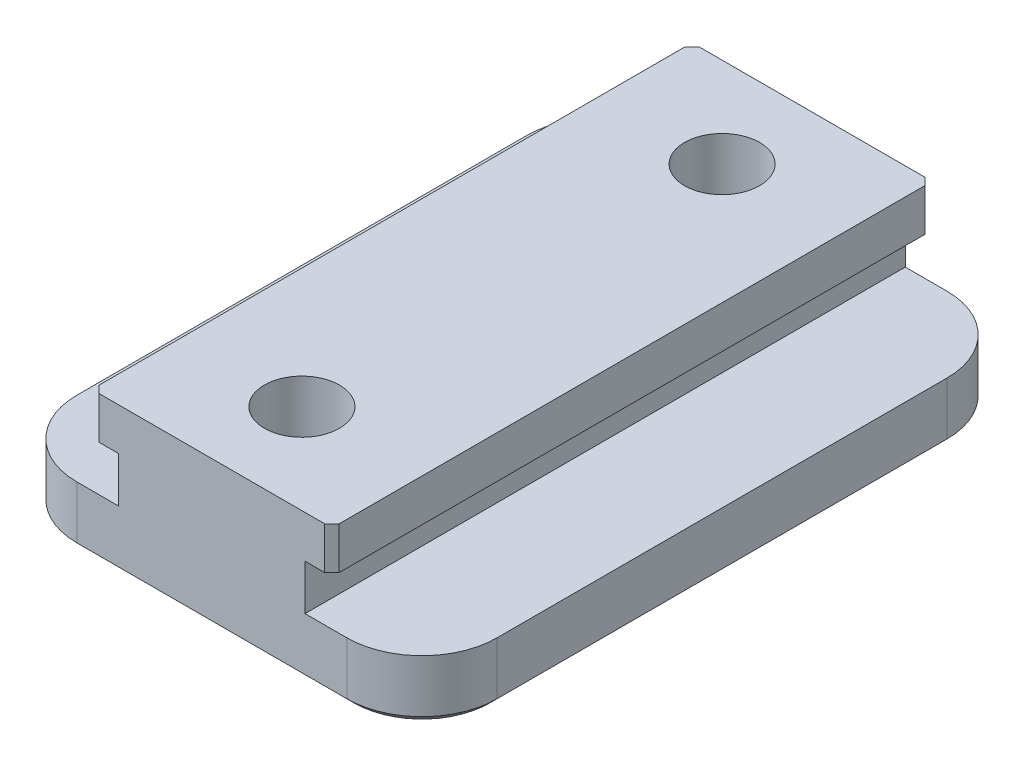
from build123d import *

# Parameters (mm, degrees)
BOSS_EXTRUDE1_DEPTH = 31.75
FILLET1_R           = 7.9502
CHAMFER1_SIZE       = 0.762
CHAMFER3_SIZE       = 0.762
TAPPED_HOLE1_D      = 7.9375


with BuildPart() as part:
    # Sketch1 → Boss-Extrude1 (new, symmetric)
    with BuildSketch(Plane.XY):
        Polygon((12.7, 6.096), (-12.7, 6.096), (-12.7, 1.6256), (-9.8552, 1.6256), (-9.8552, -3.175), (-22.225, -3.175), (-22.225, -9.525), (22.225, -9.525), (22.225, -3.175), (9.8552, -3.175), (9.8552, 1.6256), (12.7, 1.6256), align=None)
    extrude(amount=BOSS_EXTRUDE1_DEPTH, both=True)

    # Fillet1
    fillet1_edges = [part.edges().sort_by_distance(p)[0] for p in [
        (22.225, -6.35, -31.75),
        (-22.225, -6.35, -31.75),
        (-22.225, -6.35, 31.75),
        (22.225, -6.35, 31.75),
    ]]
    fillet(fillet1_edges, radius=FILLET1_R)

    # Chamfer1
    chamfer1_edges = [part.edges().sort_by_distance(p)[0] for p in [
        (0, -9.525, 31.75),
        (0, -9.525, -31.75),
        (22.225, -9.525, 0),
        (-22.225, -9.525, 0),
        (19.896440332, -9.525, 29.421440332),
        (19.896440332, -9.525, -29.421440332),
        (-19.896440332, -9.525, -29.421440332),
        (-19.896440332, -9.525, 29.421440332),
    ]]
    chamfer(chamfer1_edges, length=CHAMFER1_SIZE)

    # Chamfer3
    chamfer3_edges = [part.edges().sort_by_distance(p)[0] for p in [
        (12.7, 3.8608, -31.75),
        (-12.7, 3.8608, -31.75),
        (12.7, 3.8608, 31.75),
        (-12.7, 3.8608, 31.75),
    ]]
    chamfer(chamfer3_edges, length=CHAMFER3_SIZE)

    # Tapped Hole1 (through all)
    with Locations(Plane(origin=(0, -9.525, 0), x_dir=(-1, 0, 0), z_dir=(0, -1, 0))):
        with Locations((0, 22.225)):
            tapped_hole1 = Hole(TAPPED_HOLE1_D / 2)

    # Mirror1: Tapped Hole1 across plane
    add(tapped_hole1.mirror(Plane.XY), mode=Mode.SUBTRACT)


solid = part.part
